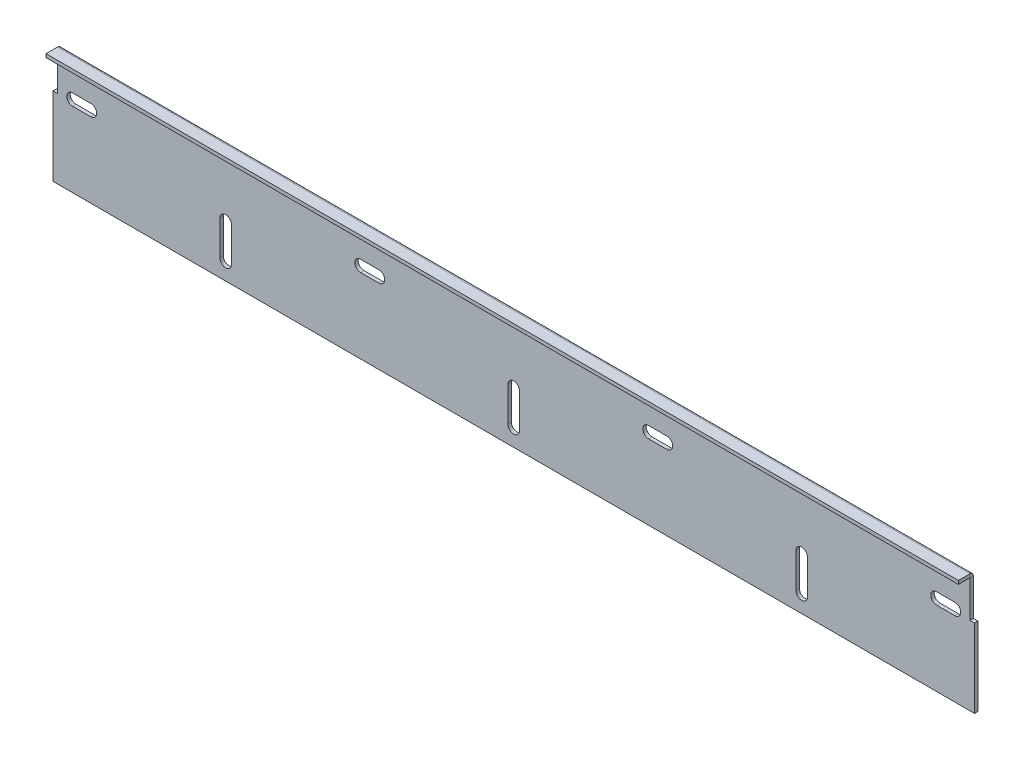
ISO-10303-21;
HEADER;
FILE_DESCRIPTION(('STEP AP214'),'2;1');
FILE_NAME('part.step','',(''),(''),'','','');
FILE_SCHEMA(('AUTOMOTIVE_DESIGN { 1 0 10303 214 1 1 1 1 }'));
ENDSEC;
DATA;
#1=APPLICATION_CONTEXT('core data for automotive mechanical design processes');
#2=APPLICATION_PROTOCOL_DEFINITION('international standard','automotive_design',2000,#1);
#3=PRODUCT_CONTEXT('',#1,'mechanical');
#4=PRODUCT('Part','Part','',(#3));
#5=PRODUCT_RELATED_PRODUCT_CATEGORY('part','',(#4));
#6=PRODUCT_DEFINITION_FORMATION('','',#4);
#7=PRODUCT_DEFINITION_CONTEXT('part definition',#1,'design');
#8=PRODUCT_DEFINITION('design','',#6,#7);
#9=PRODUCT_DEFINITION_SHAPE('','',#8);
#10=(LENGTH_UNIT() NAMED_UNIT(*) SI_UNIT(.MILLI.,.METRE.));
#11=(NAMED_UNIT(*) PLANE_ANGLE_UNIT() SI_UNIT($,.RADIAN.));
#12=(NAMED_UNIT(*) SI_UNIT($,.STERADIAN.) SOLID_ANGLE_UNIT());
#13=UNCERTAINTY_MEASURE_WITH_UNIT(LENGTH_MEASURE(1.E-05),#10,'distance_accuracy_value','');
#14=(GEOMETRIC_REPRESENTATION_CONTEXT(3) GLOBAL_UNCERTAINTY_ASSIGNED_CONTEXT((#13)) GLOBAL_UNIT_ASSIGNED_CONTEXT((#10,
#11,#12)) REPRESENTATION_CONTEXT('',''));
#15=CARTESIAN_POINT('',(0.,0.,0.));
#16=DIRECTION('',(0.,0.,1.));
#17=DIRECTION('',(1.,0.,0.));
#18=AXIS2_PLACEMENT_3D('',#15,#16,#17);
#19=CARTESIAN_POINT('',(-400.,-1551.62497012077,13.));
#20=DIRECTION('',(0.,0.,1.));
#21=DIRECTION('',(0.,-1.,0.));
#22=AXIS2_PLACEMENT_3D('',#19,#20,#21);
#23=PLANE('',#22);
#24=DIRECTION('',(-1.,0.,0.));
#25=VECTOR('',#24,1.);
#26=CARTESIAN_POINT('',(-400.,51.5,13.));
#27=LINE('',#26,#25);
#28=CARTESIAN_POINT('',(396.,51.5,13.));
#29=VERTEX_POINT('',#28);
#30=CARTESIAN_POINT('',(-396.,51.5,13.));
#31=VERTEX_POINT('',#30);
#32=EDGE_CURVE('E502',#29,#31,#27,.T.);
#33=ORIENTED_EDGE('',*,*,#32,.T.);
#34=DIRECTION('',(0.,1.,0.));
#35=VECTOR('',#34,1.);
#36=CARTESIAN_POINT('',(-396.,51.5,13.));
#37=LINE('',#36,#35);
#38=CARTESIAN_POINT('',(-396.,48.5,13.));
#39=VERTEX_POINT('',#38);
#40=EDGE_CURVE('E515',#31,#39,#37,.F.);
#41=ORIENTED_EDGE('',*,*,#40,.T.);
#42=DIRECTION('',(1.,0.,0.));
#43=VECTOR('',#42,1.);
#44=CARTESIAN_POINT('',(-400.,48.5,13.));
#45=LINE('',#44,#43);
#46=CARTESIAN_POINT('',(396.,48.5,13.));
#47=VERTEX_POINT('',#46);
#48=EDGE_CURVE('E41',#39,#47,#45,.T.);
#49=ORIENTED_EDGE('',*,*,#48,.T.);
#50=DIRECTION('',(0.,1.,0.));
#51=VECTOR('',#50,1.);
#52=CARTESIAN_POINT('',(396.,51.5,13.));
#53=LINE('',#52,#51);
#54=EDGE_CURVE('E513',#29,#47,#53,.F.);
#55=ORIENTED_EDGE('',*,*,#54,.F.);
#56=EDGE_LOOP('',(#33,#41,#49,#55));
#57=FACE_BOUND('',#56,.T.);
#58=ADVANCED_FACE('F34',(#57),#23,.T.);
#59=CARTESIAN_POINT('',(-400.,48.5,13.));
#60=DIRECTION('',(0.,1.,0.));
#61=DIRECTION('',(-1.,0.,0.));
#62=AXIS2_PLACEMENT_3D('',#59,#60,#61);
#63=PLANE('',#62);
#64=DIRECTION('',(0.,0.,-1.));
#65=VECTOR('',#64,1.);
#66=CARTESIAN_POINT('',(-396.,48.5,3.));
#67=LINE('',#66,#65);
#68=CARTESIAN_POINT('',(-396.,48.5,3.001));
#69=VERTEX_POINT('',#68);
#70=EDGE_CURVE('E643',#39,#69,#67,.T.);
#71=ORIENTED_EDGE('',*,*,#70,.T.);
#72=DIRECTION('',(1.,0.,0.));
#73=VECTOR('',#72,1.);
#74=CARTESIAN_POINT('',(400.,48.4999999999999,3.001));
#75=LINE('',#74,#73);
#76=CARTESIAN_POINT('',(396.,48.4999999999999,3.001));
#77=VERTEX_POINT('',#76);
#78=EDGE_CURVE('E11',#69,#77,#75,.T.);
#79=ORIENTED_EDGE('',*,*,#78,.T.);
#80=DIRECTION('',(0.,0.,-1.));
#81=VECTOR('',#80,1.);
#82=CARTESIAN_POINT('',(396.,48.5,3.));
#83=LINE('',#82,#81);
#84=EDGE_CURVE('E519',#47,#77,#83,.T.);
#85=ORIENTED_EDGE('',*,*,#84,.F.);
#86=ORIENTED_EDGE('',*,*,#48,.F.);
#87=EDGE_LOOP('',(#71,#79,#85,#86));
#88=FACE_BOUND('',#87,.T.);
#89=ADVANCED_FACE('F523',(#88),#63,.F.);
#90=CARTESIAN_POINT('',(-400.,51.5,3.));
#91=DIRECTION('',(0.,-1.,0.));
#92=DIRECTION('',(0.,0.,-1.));
#93=AXIS2_PLACEMENT_3D('',#90,#91,#92);
#94=PLANE('',#93);
#95=DIRECTION('',(0.,0.,-1.));
#96=VECTOR('',#95,1.);
#97=CARTESIAN_POINT('',(-396.,51.5,3.));
#98=LINE('',#97,#96);
#99=CARTESIAN_POINT('',(-396.,51.5,3.00100000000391));
#100=VERTEX_POINT('',#99);
#101=EDGE_CURVE('E646',#31,#100,#98,.T.);
#102=ORIENTED_EDGE('',*,*,#101,.F.);
#103=ORIENTED_EDGE('',*,*,#32,.F.);
#104=DIRECTION('',(0.,0.,-1.));
#105=VECTOR('',#104,1.);
#106=CARTESIAN_POINT('',(396.,51.5,3.));
#107=LINE('',#106,#105);
#108=CARTESIAN_POINT('',(396.,51.5,3.001));
#109=VERTEX_POINT('',#108);
#110=EDGE_CURVE('E521',#29,#109,#107,.T.);
#111=ORIENTED_EDGE('',*,*,#110,.T.);
#112=DIRECTION('',(-1.,0.,0.));
#113=VECTOR('',#112,1.);
#114=CARTESIAN_POINT('',(400.,51.5,3.001));
#115=LINE('',#114,#113);
#116=EDGE_CURVE('E505',#109,#100,#115,.T.);
#117=ORIENTED_EDGE('',*,*,#116,.T.);
#118=EDGE_LOOP('',(#102,#103,#111,#117));
#119=FACE_BOUND('',#118,.T.);
#120=ADVANCED_FACE('F661',(#119),#94,.F.);
#121=CARTESIAN_POINT('',(-400.,-51.5,3.));
#122=DIRECTION('',(0.,0.,1.));
#123=DIRECTION('',(1.,0.,0.));
#124=AXIS2_PLACEMENT_3D('',#121,#122,#123);
#125=PLANE('',#124);
#126=DIRECTION('',(0.,-1.,0.));
#127=VECTOR('',#126,1.);
#128=CARTESIAN_POINT('',(245.,-6.5,3.));
#129=LINE('',#128,#127);
#130=CARTESIAN_POINT('',(245.,-6.5,3.));
#131=VERTEX_POINT('',#130);
#132=CARTESIAN_POINT('',(245.,-36.5,3.));
#133=VERTEX_POINT('',#132);
#134=EDGE_CURVE('E334',#131,#133,#129,.T.);
#135=ORIENTED_EDGE('',*,*,#134,.F.);
#136=CARTESIAN_POINT('',(250.,-6.5,3.));
#137=DIRECTION('',(0.,0.,1.));
#138=DIRECTION('',(1.,0.,0.));
#139=AXIS2_PLACEMENT_3D('',#136,#137,#138);
#140=CIRCLE('',#139,5.);
#141=CARTESIAN_POINT('',(255.,-6.5,3.));
#142=VERTEX_POINT('',#141);
#143=EDGE_CURVE('E339',#142,#131,#140,.T.);
#144=ORIENTED_EDGE('',*,*,#143,.F.);
#145=DIRECTION('',(0.,1.,0.));
#146=VECTOR('',#145,1.);
#147=CARTESIAN_POINT('',(255.,-6.5,3.));
#148=LINE('',#147,#146);
#149=CARTESIAN_POINT('',(255.,-36.5,3.));
#150=VERTEX_POINT('',#149);
#151=EDGE_CURVE('E345',#150,#142,#148,.T.);
#152=ORIENTED_EDGE('',*,*,#151,.F.);
#153=CARTESIAN_POINT('',(250.,-36.5,3.));
#154=DIRECTION('',(0.,0.,1.));
#155=DIRECTION('',(1.,0.,0.));
#156=AXIS2_PLACEMENT_3D('',#153,#154,#155);
#157=CIRCLE('',#156,5.);
#158=EDGE_CURVE('E351',#133,#150,#157,.T.);
#159=ORIENTED_EDGE('',*,*,#158,.F.);
#160=EDGE_LOOP('',(#135,#144,#152,#159));
#161=FACE_BOUND('',#160,.T.);
#162=DIRECTION('',(1.,0.,0.));
#163=VECTOR('',#162,1.);
#164=CARTESIAN_POINT('',(133.,13.5,3.));
#165=LINE('',#164,#163);
#166=CARTESIAN_POINT('',(117.,13.5,3.));
#167=VERTEX_POINT('',#166);
#168=CARTESIAN_POINT('',(133.,13.5,3.));
#169=VERTEX_POINT('',#168);
#170=EDGE_CURVE('E357',#167,#169,#165,.T.);
#171=ORIENTED_EDGE('',*,*,#170,.F.);
#172=CARTESIAN_POINT('',(117.,18.5,3.));
#173=DIRECTION('',(0.,0.,1.));
#174=DIRECTION('',(1.,0.,0.));
#175=AXIS2_PLACEMENT_3D('',#172,#173,#174);
#176=CIRCLE('',#175,5.);
#177=CARTESIAN_POINT('',(117.,23.5,3.));
#178=VERTEX_POINT('',#177);
#179=EDGE_CURVE('E362',#178,#167,#176,.T.);
#180=ORIENTED_EDGE('',*,*,#179,.F.);
#181=DIRECTION('',(-1.,0.,0.));
#182=VECTOR('',#181,1.);
#183=CARTESIAN_POINT('',(117.,23.5,3.));
#184=LINE('',#183,#182);
#185=CARTESIAN_POINT('',(133.,23.5,3.));
#186=VERTEX_POINT('',#185);
#187=EDGE_CURVE('E368',#186,#178,#184,.T.);
#188=ORIENTED_EDGE('',*,*,#187,.F.);
#189=CARTESIAN_POINT('',(133.,18.5,3.));
#190=DIRECTION('',(0.,0.,1.));
#191=DIRECTION('',(1.,0.,0.));
#192=AXIS2_PLACEMENT_3D('',#189,#190,#191);
#193=CIRCLE('',#192,5.);
#194=EDGE_CURVE('E374',#169,#186,#193,.T.);
#195=ORIENTED_EDGE('',*,*,#194,.F.);
#196=EDGE_LOOP('',(#171,#180,#188,#195));
#197=FACE_BOUND('',#196,.T.);
#198=DIRECTION('',(1.,0.,0.));
#199=VECTOR('',#198,1.);
#200=CARTESIAN_POINT('',(-117.,13.5,3.));
#201=LINE('',#200,#199);
#202=CARTESIAN_POINT('',(-133.,13.5,3.));
#203=VERTEX_POINT('',#202);
#204=CARTESIAN_POINT('',(-117.,13.5,3.));
#205=VERTEX_POINT('',#204);
#206=EDGE_CURVE('E380',#203,#205,#201,.T.);
#207=ORIENTED_EDGE('',*,*,#206,.F.);
#208=CARTESIAN_POINT('',(-133.,18.5,3.));
#209=DIRECTION('',(0.,0.,1.));
#210=DIRECTION('',(1.,0.,0.));
#211=AXIS2_PLACEMENT_3D('',#208,#209,#210);
#212=CIRCLE('',#211,5.);
#213=CARTESIAN_POINT('',(-133.,23.5,3.));
#214=VERTEX_POINT('',#213);
#215=EDGE_CURVE('E385',#214,#203,#212,.T.);
#216=ORIENTED_EDGE('',*,*,#215,.F.);
#217=DIRECTION('',(-1.,0.,0.));
#218=VECTOR('',#217,1.);
#219=CARTESIAN_POINT('',(-133.,23.5,3.));
#220=LINE('',#219,#218);
#221=CARTESIAN_POINT('',(-117.,23.5,3.));
#222=VERTEX_POINT('',#221);
#223=EDGE_CURVE('E391',#222,#214,#220,.T.);
#224=ORIENTED_EDGE('',*,*,#223,.F.);
#225=CARTESIAN_POINT('',(-117.,18.5,3.));
#226=DIRECTION('',(0.,0.,1.));
#227=DIRECTION('',(1.,0.,0.));
#228=AXIS2_PLACEMENT_3D('',#225,#226,#227);
#229=CIRCLE('',#228,5.);
#230=EDGE_CURVE('E397',#205,#222,#229,.T.);
#231=ORIENTED_EDGE('',*,*,#230,.F.);
#232=EDGE_LOOP('',(#207,#216,#224,#231));
#233=FACE_BOUND('',#232,.T.);
#234=DIRECTION('',(1.,0.,0.));
#235=VECTOR('',#234,1.);
#236=CARTESIAN_POINT('',(-383.,13.5,3.));
#237=LINE('',#236,#235);
#238=CARTESIAN_POINT('',(-383.,13.5,3.));
#239=VERTEX_POINT('',#238);
#240=CARTESIAN_POINT('',(-367.,13.5,3.));
#241=VERTEX_POINT('',#240);
#242=EDGE_CURVE('E403',#239,#241,#237,.T.);
#243=ORIENTED_EDGE('',*,*,#242,.F.);
#244=CARTESIAN_POINT('',(-383.,18.5,3.));
#245=DIRECTION('',(0.,0.,1.));
#246=DIRECTION('',(1.,0.,0.));
#247=AXIS2_PLACEMENT_3D('',#244,#245,#246);
#248=CIRCLE('',#247,5.);
#249=CARTESIAN_POINT('',(-383.,23.5,3.));
#250=VERTEX_POINT('',#249);
#251=EDGE_CURVE('E408',#250,#239,#248,.T.);
#252=ORIENTED_EDGE('',*,*,#251,.F.);
#253=DIRECTION('',(-1.,0.,0.));
#254=VECTOR('',#253,1.);
#255=CARTESIAN_POINT('',(-383.,23.5,3.));
#256=LINE('',#255,#254);
#257=CARTESIAN_POINT('',(-367.,23.5,3.));
#258=VERTEX_POINT('',#257);
#259=EDGE_CURVE('E414',#258,#250,#256,.T.);
#260=ORIENTED_EDGE('',*,*,#259,.F.);
#261=CARTESIAN_POINT('',(-367.,18.5,3.));
#262=DIRECTION('',(0.,0.,1.));
#263=DIRECTION('',(1.,0.,0.));
#264=AXIS2_PLACEMENT_3D('',#261,#262,#263);
#265=CIRCLE('',#264,5.);
#266=EDGE_CURVE('E420',#241,#258,#265,.T.);
#267=ORIENTED_EDGE('',*,*,#266,.F.);
#268=EDGE_LOOP('',(#243,#252,#260,#267));
#269=FACE_BOUND('',#268,.T.);
#270=DIRECTION('',(0.,-1.,0.));
#271=VECTOR('',#270,1.);
#272=CARTESIAN_POINT('',(-255.,-6.5,3.));
#273=LINE('',#272,#271);
#274=CARTESIAN_POINT('',(-255.,-6.5,3.));
#275=VERTEX_POINT('',#274);
#276=CARTESIAN_POINT('',(-255.,-36.5,3.));
#277=VERTEX_POINT('',#276);
#278=EDGE_CURVE('E426',#275,#277,#273,.T.);
#279=ORIENTED_EDGE('',*,*,#278,.F.);
#280=CARTESIAN_POINT('',(-250.,-6.5,3.));
#281=DIRECTION('',(0.,0.,1.));
#282=DIRECTION('',(1.,0.,0.));
#283=AXIS2_PLACEMENT_3D('',#280,#281,#282);
#284=CIRCLE('',#283,5.);
#285=CARTESIAN_POINT('',(-245.,-6.5,3.));
#286=VERTEX_POINT('',#285);
#287=EDGE_CURVE('E431',#286,#275,#284,.T.);
#288=ORIENTED_EDGE('',*,*,#287,.F.);
#289=DIRECTION('',(0.,1.,0.));
#290=VECTOR('',#289,1.);
#291=CARTESIAN_POINT('',(-245.,-6.5,3.));
#292=LINE('',#291,#290);
#293=CARTESIAN_POINT('',(-245.,-36.5,3.));
#294=VERTEX_POINT('',#293);
#295=EDGE_CURVE('E437',#294,#286,#292,.T.);
#296=ORIENTED_EDGE('',*,*,#295,.F.);
#297=CARTESIAN_POINT('',(-250.,-36.5,3.));
#298=DIRECTION('',(0.,0.,1.));
#299=DIRECTION('',(1.,0.,0.));
#300=AXIS2_PLACEMENT_3D('',#297,#298,#299);
#301=CIRCLE('',#300,5.);
#302=EDGE_CURVE('E443',#277,#294,#301,.T.);
#303=ORIENTED_EDGE('',*,*,#302,.F.);
#304=EDGE_LOOP('',(#279,#288,#296,#303));
#305=FACE_BOUND('',#304,.T.);
#306=DIRECTION('',(0.,-1.,0.));
#307=VECTOR('',#306,1.);
#308=CARTESIAN_POINT('',(-5.,-6.5,3.));
#309=LINE('',#308,#307);
#310=CARTESIAN_POINT('',(-5.,-6.5,3.));
#311=VERTEX_POINT('',#310);
#312=CARTESIAN_POINT('',(-5.,-36.5,3.));
#313=VERTEX_POINT('',#312);
#314=EDGE_CURVE('E449',#311,#313,#309,.T.);
#315=ORIENTED_EDGE('',*,*,#314,.F.);
#316=CARTESIAN_POINT('',(0.,-6.5,3.));
#317=DIRECTION('',(0.,0.,1.));
#318=DIRECTION('',(1.,0.,0.));
#319=AXIS2_PLACEMENT_3D('',#316,#317,#318);
#320=CIRCLE('',#319,5.);
#321=CARTESIAN_POINT('',(4.99999999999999,-6.5,3.));
#322=VERTEX_POINT('',#321);
#323=EDGE_CURVE('E454',#322,#311,#320,.T.);
#324=ORIENTED_EDGE('',*,*,#323,.F.);
#325=DIRECTION('',(0.,1.,0.));
#326=VECTOR('',#325,1.);
#327=CARTESIAN_POINT('',(4.99999999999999,-6.5,3.));
#328=LINE('',#327,#326);
#329=CARTESIAN_POINT('',(5.,-36.5,3.));
#330=VERTEX_POINT('',#329);
#331=EDGE_CURVE('E460',#330,#322,#328,.T.);
#332=ORIENTED_EDGE('',*,*,#331,.F.);
#333=CARTESIAN_POINT('',(0.,-36.5,3.));
#334=DIRECTION('',(0.,0.,1.));
#335=DIRECTION('',(1.,0.,0.));
#336=AXIS2_PLACEMENT_3D('',#333,#334,#335);
#337=CIRCLE('',#336,5.);
#338=EDGE_CURVE('E466',#313,#330,#337,.T.);
#339=ORIENTED_EDGE('',*,*,#338,.F.);
#340=EDGE_LOOP('',(#315,#324,#332,#339));
#341=FACE_BOUND('',#340,.T.);
#342=DIRECTION('',(1.,0.,0.));
#343=VECTOR('',#342,1.);
#344=CARTESIAN_POINT('',(383.,13.5,3.));
#345=LINE('',#344,#343);
#346=CARTESIAN_POINT('',(367.,13.5,3.));
#347=VERTEX_POINT('',#346);
#348=CARTESIAN_POINT('',(383.,13.5,3.));
#349=VERTEX_POINT('',#348);
#350=EDGE_CURVE('E472',#347,#349,#345,.T.);
#351=ORIENTED_EDGE('',*,*,#350,.F.);
#352=CARTESIAN_POINT('',(367.,18.5,3.));
#353=DIRECTION('',(0.,0.,1.));
#354=DIRECTION('',(1.,0.,0.));
#355=AXIS2_PLACEMENT_3D('',#352,#353,#354);
#356=CIRCLE('',#355,5.);
#357=CARTESIAN_POINT('',(367.,23.5,3.));
#358=VERTEX_POINT('',#357);
#359=EDGE_CURVE('E477',#358,#347,#356,.T.);
#360=ORIENTED_EDGE('',*,*,#359,.F.);
#361=DIRECTION('',(-1.,0.,0.));
#362=VECTOR('',#361,1.);
#363=CARTESIAN_POINT('',(367.,23.5,3.));
#364=LINE('',#363,#362);
#365=CARTESIAN_POINT('',(383.,23.5,3.));
#366=VERTEX_POINT('',#365);
#367=EDGE_CURVE('E483',#366,#358,#364,.T.);
#368=ORIENTED_EDGE('',*,*,#367,.F.);
#369=CARTESIAN_POINT('',(383.,18.5,3.));
#370=DIRECTION('',(0.,0.,1.));
#371=DIRECTION('',(1.,0.,0.));
#372=AXIS2_PLACEMENT_3D('',#369,#370,#371);
#373=CIRCLE('',#372,5.);
#374=EDGE_CURVE('E489',#349,#366,#373,.T.);
#375=ORIENTED_EDGE('',*,*,#374,.F.);
#376=EDGE_LOOP('',(#351,#360,#368,#375));
#377=FACE_BOUND('',#376,.T.);
#378=DIRECTION('',(0.,-1.,0.));
#379=VECTOR('',#378,1.);
#380=CARTESIAN_POINT('',(-396.,-51.5,3.));
#381=LINE('',#380,#379);
#382=CARTESIAN_POINT('',(-396.,48.499,3.00000000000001));
#383=VERTEX_POINT('',#382);
#384=CARTESIAN_POINT('',(-396.,16.5,3.));
#385=VERTEX_POINT('',#384);
#386=EDGE_CURVE('E292',#383,#385,#381,.T.);
#387=ORIENTED_EDGE('',*,*,#386,.T.);
#388=DIRECTION('',(-1.,0.,0.));
#389=VECTOR('',#388,1.);
#390=CARTESIAN_POINT('',(-400.,16.5,3.));
#391=LINE('',#390,#389);
#392=CARTESIAN_POINT('',(-400.,16.5,3.));
#393=VERTEX_POINT('',#392);
#394=EDGE_CURVE('E301',#385,#393,#391,.T.);
#395=ORIENTED_EDGE('',*,*,#394,.T.);
#396=DIRECTION('',(0.,-1.,0.));
#397=VECTOR('',#396,1.);
#398=CARTESIAN_POINT('',(-400.,51.5,3.));
#399=LINE('',#398,#397);
#400=CARTESIAN_POINT('',(-400.,-51.5,2.99999999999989));
#401=VERTEX_POINT('',#400);
#402=EDGE_CURVE('E322',#393,#401,#399,.T.);
#403=ORIENTED_EDGE('',*,*,#402,.T.);
#404=DIRECTION('',(1.,0.,0.));
#405=VECTOR('',#404,1.);
#406=CARTESIAN_POINT('',(-400.,-51.5,3.));
#407=LINE('',#406,#405);
#408=CARTESIAN_POINT('',(400.,-51.5,3.));
#409=VERTEX_POINT('',#408);
#410=EDGE_CURVE('E325',#401,#409,#407,.T.);
#411=ORIENTED_EDGE('',*,*,#410,.T.);
#412=DIRECTION('',(0.,1.,0.));
#413=VECTOR('',#412,1.);
#414=CARTESIAN_POINT('',(400.,51.5,3.));
#415=LINE('',#414,#413);
#416=CARTESIAN_POINT('',(400.,16.5,3.));
#417=VERTEX_POINT('',#416);
#418=EDGE_CURVE('E323',#409,#417,#415,.T.);
#419=ORIENTED_EDGE('',*,*,#418,.T.);
#420=DIRECTION('',(1.,0.,0.));
#421=VECTOR('',#420,1.);
#422=CARTESIAN_POINT('',(-400.,16.5,3.));
#423=LINE('',#422,#421);
#424=CARTESIAN_POINT('',(396.,16.5,3.));
#425=VERTEX_POINT('',#424);
#426=EDGE_CURVE('E626',#425,#417,#423,.T.);
#427=ORIENTED_EDGE('',*,*,#426,.F.);
#428=DIRECTION('',(0.,1.,0.));
#429=VECTOR('',#428,1.);
#430=CARTESIAN_POINT('',(396.,-51.5,3.));
#431=LINE('',#430,#429);
#432=CARTESIAN_POINT('',(396.,48.499,3.00000000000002));
#433=VERTEX_POINT('',#432);
#434=EDGE_CURVE('E321',#433,#425,#431,.F.);
#435=ORIENTED_EDGE('',*,*,#434,.F.);
#436=DIRECTION('',(-1.,0.,0.));
#437=VECTOR('',#436,1.);
#438=CARTESIAN_POINT('',(400.,48.499,2.99999999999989));
#439=LINE('',#438,#437);
#440=EDGE_CURVE('E316',#433,#383,#439,.T.);
#441=ORIENTED_EDGE('',*,*,#440,.T.);
#442=EDGE_LOOP('',(#387,#395,#403,#411,#419,#427,#435,#441));
#443=FACE_BOUND('',#442,.T.);
#444=ADVANCED_FACE('F319',(#161,#197,#233,#269,#305,#341,#377,#443),#125,.T.);
#445=CARTESIAN_POINT('',(-400.,-51.5,0.));
#446=DIRECTION('',(0.,0.,1.));
#447=DIRECTION('',(1.,0.,0.));
#448=AXIS2_PLACEMENT_3D('',#445,#446,#447);
#449=PLANE('',#448);
#450=CARTESIAN_POINT('',(367.,18.5,0.));
#451=DIRECTION('',(0.,0.,1.));
#452=DIRECTION('',(1.,0.,0.));
#453=AXIS2_PLACEMENT_3D('',#450,#451,#452);
#454=CIRCLE('',#453,5.);
#455=CARTESIAN_POINT('',(367.,23.5,0.));
#456=VERTEX_POINT('',#455);
#457=CARTESIAN_POINT('',(367.,13.5,0.));
#458=VERTEX_POINT('',#457);
#459=EDGE_CURVE('E596',#456,#458,#454,.T.);
#460=ORIENTED_EDGE('',*,*,#459,.T.);
#461=DIRECTION('',(1.,0.,0.));
#462=VECTOR('',#461,1.);
#463=CARTESIAN_POINT('',(383.,13.5,0.));
#464=LINE('',#463,#462);
#465=CARTESIAN_POINT('',(383.,13.5,0.));
#466=VERTEX_POINT('',#465);
#467=EDGE_CURVE('E594',#458,#466,#464,.T.);
#468=ORIENTED_EDGE('',*,*,#467,.T.);
#469=CARTESIAN_POINT('',(383.,18.5,0.));
#470=DIRECTION('',(0.,0.,1.));
#471=DIRECTION('',(1.,0.,0.));
#472=AXIS2_PLACEMENT_3D('',#469,#470,#471);
#473=CIRCLE('',#472,5.);
#474=CARTESIAN_POINT('',(383.,23.5,0.));
#475=VERTEX_POINT('',#474);
#476=EDGE_CURVE('E592',#466,#475,#473,.T.);
#477=ORIENTED_EDGE('',*,*,#476,.T.);
#478=DIRECTION('',(-1.,0.,0.));
#479=VECTOR('',#478,1.);
#480=CARTESIAN_POINT('',(367.,23.5,0.));
#481=LINE('',#480,#479);
#482=EDGE_CURVE('E589',#475,#456,#481,.T.);
#483=ORIENTED_EDGE('',*,*,#482,.T.);
#484=EDGE_LOOP('',(#460,#468,#477,#483));
#485=FACE_BOUND('',#484,.T.);
#486=CARTESIAN_POINT('',(0.,-6.5,0.));
#487=DIRECTION('',(0.,0.,1.));
#488=DIRECTION('',(1.,0.,0.));
#489=AXIS2_PLACEMENT_3D('',#486,#487,#488);
#490=CIRCLE('',#489,5.);
#491=CARTESIAN_POINT('',(4.99999999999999,-6.5,0.));
#492=VERTEX_POINT('',#491);
#493=CARTESIAN_POINT('',(-5.,-6.5,0.));
#494=VERTEX_POINT('',#493);
#495=EDGE_CURVE('E587',#492,#494,#490,.T.);
#496=ORIENTED_EDGE('',*,*,#495,.T.);
#497=DIRECTION('',(0.,-1.,0.));
#498=VECTOR('',#497,1.);
#499=CARTESIAN_POINT('',(-5.,-6.5,0.));
#500=LINE('',#499,#498);
#501=CARTESIAN_POINT('',(-5.,-36.5,0.));
#502=VERTEX_POINT('',#501);
#503=EDGE_CURVE('E585',#494,#502,#500,.T.);
#504=ORIENTED_EDGE('',*,*,#503,.T.);
#505=CARTESIAN_POINT('',(0.,-36.5,0.));
#506=DIRECTION('',(0.,0.,1.));
#507=DIRECTION('',(1.,0.,0.));
#508=AXIS2_PLACEMENT_3D('',#505,#506,#507);
#509=CIRCLE('',#508,5.);
#510=CARTESIAN_POINT('',(5.,-36.5,0.));
#511=VERTEX_POINT('',#510);
#512=EDGE_CURVE('E583',#502,#511,#509,.T.);
#513=ORIENTED_EDGE('',*,*,#512,.T.);
#514=DIRECTION('',(0.,1.,0.));
#515=VECTOR('',#514,1.);
#516=CARTESIAN_POINT('',(4.99999999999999,-6.5,0.));
#517=LINE('',#516,#515);
#518=EDGE_CURVE('E580',#511,#492,#517,.T.);
#519=ORIENTED_EDGE('',*,*,#518,.T.);
#520=EDGE_LOOP('',(#496,#504,#513,#519));
#521=FACE_BOUND('',#520,.T.);
#522=CARTESIAN_POINT('',(-250.,-6.5,0.));
#523=DIRECTION('',(0.,0.,1.));
#524=DIRECTION('',(1.,0.,0.));
#525=AXIS2_PLACEMENT_3D('',#522,#523,#524);
#526=CIRCLE('',#525,5.);
#527=CARTESIAN_POINT('',(-245.,-6.5,0.));
#528=VERTEX_POINT('',#527);
#529=CARTESIAN_POINT('',(-255.,-6.5,0.));
#530=VERTEX_POINT('',#529);
#531=EDGE_CURVE('E578',#528,#530,#526,.T.);
#532=ORIENTED_EDGE('',*,*,#531,.T.);
#533=DIRECTION('',(0.,-1.,0.));
#534=VECTOR('',#533,1.);
#535=CARTESIAN_POINT('',(-255.,-6.5,0.));
#536=LINE('',#535,#534);
#537=CARTESIAN_POINT('',(-255.,-36.5,0.));
#538=VERTEX_POINT('',#537);
#539=EDGE_CURVE('E576',#530,#538,#536,.T.);
#540=ORIENTED_EDGE('',*,*,#539,.T.);
#541=CARTESIAN_POINT('',(-250.,-36.5,0.));
#542=DIRECTION('',(0.,0.,1.));
#543=DIRECTION('',(1.,0.,0.));
#544=AXIS2_PLACEMENT_3D('',#541,#542,#543);
#545=CIRCLE('',#544,5.);
#546=CARTESIAN_POINT('',(-245.,-36.5,0.));
#547=VERTEX_POINT('',#546);
#548=EDGE_CURVE('E574',#538,#547,#545,.T.);
#549=ORIENTED_EDGE('',*,*,#548,.T.);
#550=DIRECTION('',(0.,1.,0.));
#551=VECTOR('',#550,1.);
#552=CARTESIAN_POINT('',(-245.,-6.5,0.));
#553=LINE('',#552,#551);
#554=EDGE_CURVE('E571',#547,#528,#553,.T.);
#555=ORIENTED_EDGE('',*,*,#554,.T.);
#556=EDGE_LOOP('',(#532,#540,#549,#555));
#557=FACE_BOUND('',#556,.T.);
#558=CARTESIAN_POINT('',(-383.,18.5,0.));
#559=DIRECTION('',(0.,0.,1.));
#560=DIRECTION('',(1.,0.,0.));
#561=AXIS2_PLACEMENT_3D('',#558,#559,#560);
#562=CIRCLE('',#561,5.);
#563=CARTESIAN_POINT('',(-383.,23.5,0.));
#564=VERTEX_POINT('',#563);
#565=CARTESIAN_POINT('',(-383.,13.5,0.));
#566=VERTEX_POINT('',#565);
#567=EDGE_CURVE('E569',#564,#566,#562,.T.);
#568=ORIENTED_EDGE('',*,*,#567,.T.);
#569=DIRECTION('',(1.,0.,0.));
#570=VECTOR('',#569,1.);
#571=CARTESIAN_POINT('',(-383.,13.5,0.));
#572=LINE('',#571,#570);
#573=CARTESIAN_POINT('',(-367.,13.5,0.));
#574=VERTEX_POINT('',#573);
#575=EDGE_CURVE('E567',#566,#574,#572,.T.);
#576=ORIENTED_EDGE('',*,*,#575,.T.);
#577=CARTESIAN_POINT('',(-367.,18.5,0.));
#578=DIRECTION('',(0.,0.,1.));
#579=DIRECTION('',(1.,0.,0.));
#580=AXIS2_PLACEMENT_3D('',#577,#578,#579);
#581=CIRCLE('',#580,5.);
#582=CARTESIAN_POINT('',(-367.,23.5,0.));
#583=VERTEX_POINT('',#582);
#584=EDGE_CURVE('E565',#574,#583,#581,.T.);
#585=ORIENTED_EDGE('',*,*,#584,.T.);
#586=DIRECTION('',(-1.,0.,0.));
#587=VECTOR('',#586,1.);
#588=CARTESIAN_POINT('',(-383.,23.5,0.));
#589=LINE('',#588,#587);
#590=EDGE_CURVE('E562',#583,#564,#589,.T.);
#591=ORIENTED_EDGE('',*,*,#590,.T.);
#592=EDGE_LOOP('',(#568,#576,#585,#591));
#593=FACE_BOUND('',#592,.T.);
#594=CARTESIAN_POINT('',(-133.,18.5,0.));
#595=DIRECTION('',(0.,0.,1.));
#596=DIRECTION('',(1.,0.,0.));
#597=AXIS2_PLACEMENT_3D('',#594,#595,#596);
#598=CIRCLE('',#597,5.);
#599=CARTESIAN_POINT('',(-133.,23.5,0.));
#600=VERTEX_POINT('',#599);
#601=CARTESIAN_POINT('',(-133.,13.5,0.));
#602=VERTEX_POINT('',#601);
#603=EDGE_CURVE('E560',#600,#602,#598,.T.);
#604=ORIENTED_EDGE('',*,*,#603,.T.);
#605=DIRECTION('',(1.,0.,0.));
#606=VECTOR('',#605,1.);
#607=CARTESIAN_POINT('',(-117.,13.5,0.));
#608=LINE('',#607,#606);
#609=CARTESIAN_POINT('',(-117.,13.5,0.));
#610=VERTEX_POINT('',#609);
#611=EDGE_CURVE('E558',#602,#610,#608,.T.);
#612=ORIENTED_EDGE('',*,*,#611,.T.);
#613=CARTESIAN_POINT('',(-117.,18.5,0.));
#614=DIRECTION('',(0.,0.,1.));
#615=DIRECTION('',(1.,0.,0.));
#616=AXIS2_PLACEMENT_3D('',#613,#614,#615);
#617=CIRCLE('',#616,5.);
#618=CARTESIAN_POINT('',(-117.,23.5,0.));
#619=VERTEX_POINT('',#618);
#620=EDGE_CURVE('E556',#610,#619,#617,.T.);
#621=ORIENTED_EDGE('',*,*,#620,.T.);
#622=DIRECTION('',(-1.,0.,0.));
#623=VECTOR('',#622,1.);
#624=CARTESIAN_POINT('',(-133.,23.5,0.));
#625=LINE('',#624,#623);
#626=EDGE_CURVE('E553',#619,#600,#625,.T.);
#627=ORIENTED_EDGE('',*,*,#626,.T.);
#628=EDGE_LOOP('',(#604,#612,#621,#627));
#629=FACE_BOUND('',#628,.T.);
#630=CARTESIAN_POINT('',(117.,18.5,0.));
#631=DIRECTION('',(0.,0.,1.));
#632=DIRECTION('',(1.,0.,0.));
#633=AXIS2_PLACEMENT_3D('',#630,#631,#632);
#634=CIRCLE('',#633,5.);
#635=CARTESIAN_POINT('',(117.,23.5,0.));
#636=VERTEX_POINT('',#635);
#637=CARTESIAN_POINT('',(117.,13.5,0.));
#638=VERTEX_POINT('',#637);
#639=EDGE_CURVE('E551',#636,#638,#634,.T.);
#640=ORIENTED_EDGE('',*,*,#639,.T.);
#641=DIRECTION('',(1.,0.,0.));
#642=VECTOR('',#641,1.);
#643=CARTESIAN_POINT('',(133.,13.5,0.));
#644=LINE('',#643,#642);
#645=CARTESIAN_POINT('',(133.,13.5,0.));
#646=VERTEX_POINT('',#645);
#647=EDGE_CURVE('E549',#638,#646,#644,.T.);
#648=ORIENTED_EDGE('',*,*,#647,.T.);
#649=CARTESIAN_POINT('',(133.,18.5,0.));
#650=DIRECTION('',(0.,0.,1.));
#651=DIRECTION('',(1.,0.,0.));
#652=AXIS2_PLACEMENT_3D('',#649,#650,#651);
#653=CIRCLE('',#652,5.);
#654=CARTESIAN_POINT('',(133.,23.5,0.));
#655=VERTEX_POINT('',#654);
#656=EDGE_CURVE('E547',#646,#655,#653,.T.);
#657=ORIENTED_EDGE('',*,*,#656,.T.);
#658=DIRECTION('',(-1.,0.,0.));
#659=VECTOR('',#658,1.);
#660=CARTESIAN_POINT('',(117.,23.5,0.));
#661=LINE('',#660,#659);
#662=EDGE_CURVE('E544',#655,#636,#661,.T.);
#663=ORIENTED_EDGE('',*,*,#662,.T.);
#664=EDGE_LOOP('',(#640,#648,#657,#663));
#665=FACE_BOUND('',#664,.T.);
#666=CARTESIAN_POINT('',(250.,-6.5,0.));
#667=DIRECTION('',(0.,0.,1.));
#668=DIRECTION('',(1.,0.,0.));
#669=AXIS2_PLACEMENT_3D('',#666,#667,#668);
#670=CIRCLE('',#669,5.);
#671=CARTESIAN_POINT('',(255.,-6.5,0.));
#672=VERTEX_POINT('',#671);
#673=CARTESIAN_POINT('',(245.,-6.5,0.));
#674=VERTEX_POINT('',#673);
#675=EDGE_CURVE('E542',#672,#674,#670,.T.);
#676=ORIENTED_EDGE('',*,*,#675,.T.);
#677=DIRECTION('',(0.,-1.,0.));
#678=VECTOR('',#677,1.);
#679=CARTESIAN_POINT('',(245.,-6.5,0.));
#680=LINE('',#679,#678);
#681=CARTESIAN_POINT('',(245.,-36.5,0.));
#682=VERTEX_POINT('',#681);
#683=EDGE_CURVE('E540',#674,#682,#680,.T.);
#684=ORIENTED_EDGE('',*,*,#683,.T.);
#685=CARTESIAN_POINT('',(250.,-36.5,0.));
#686=DIRECTION('',(0.,0.,1.));
#687=DIRECTION('',(1.,0.,0.));
#688=AXIS2_PLACEMENT_3D('',#685,#686,#687);
#689=CIRCLE('',#688,5.);
#690=CARTESIAN_POINT('',(255.,-36.5,0.));
#691=VERTEX_POINT('',#690);
#692=EDGE_CURVE('E538',#682,#691,#689,.T.);
#693=ORIENTED_EDGE('',*,*,#692,.T.);
#694=DIRECTION('',(0.,1.,0.));
#695=VECTOR('',#694,1.);
#696=CARTESIAN_POINT('',(255.,-6.5,0.));
#697=LINE('',#696,#695);
#698=EDGE_CURVE('E535',#691,#672,#697,.T.);
#699=ORIENTED_EDGE('',*,*,#698,.T.);
#700=EDGE_LOOP('',(#676,#684,#693,#699));
#701=FACE_BOUND('',#700,.T.);
#702=DIRECTION('',(1.,0.,0.));
#703=VECTOR('',#702,1.);
#704=CARTESIAN_POINT('',(-400.,16.5,0.));
#705=LINE('',#704,#703);
#706=CARTESIAN_POINT('',(-396.,16.5,0.));
#707=VERTEX_POINT('',#706);
#708=CARTESIAN_POINT('',(-400.,16.5,0.));
#709=VERTEX_POINT('',#708);
#710=EDGE_CURVE('E48',#707,#709,#705,.F.);
#711=ORIENTED_EDGE('',*,*,#710,.F.);
#712=DIRECTION('',(0.,1.,0.));
#713=VECTOR('',#712,1.);
#714=CARTESIAN_POINT('',(-396.,-51.5,0.));
#715=LINE('',#714,#713);
#716=CARTESIAN_POINT('',(-396.,48.4989999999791,0.));
#717=VERTEX_POINT('',#716);
#718=EDGE_CURVE('E651',#717,#707,#715,.F.);
#719=ORIENTED_EDGE('',*,*,#718,.F.);
#720=DIRECTION('',(-1.,0.,0.));
#721=VECTOR('',#720,1.);
#722=CARTESIAN_POINT('',(400.,48.499,0.));
#723=LINE('',#722,#721);
#724=CARTESIAN_POINT('',(396.,48.499,0.));
#725=VERTEX_POINT('',#724);
#726=EDGE_CURVE('E498',#725,#717,#723,.T.);
#727=ORIENTED_EDGE('',*,*,#726,.F.);
#728=DIRECTION('',(0.,-1.,0.));
#729=VECTOR('',#728,1.);
#730=CARTESIAN_POINT('',(396.,64.2548377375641,0.));
#731=LINE('',#730,#729);
#732=CARTESIAN_POINT('',(396.,16.5,0.));
#733=VERTEX_POINT('',#732);
#734=EDGE_CURVE('E633',#725,#733,#731,.T.);
#735=ORIENTED_EDGE('',*,*,#734,.T.);
#736=DIRECTION('',(1.,0.,0.));
#737=VECTOR('',#736,1.);
#738=CARTESIAN_POINT('',(410.027668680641,16.5,0.));
#739=LINE('',#738,#737);
#740=CARTESIAN_POINT('',(400.,16.5,0.));
#741=VERTEX_POINT('',#740);
#742=EDGE_CURVE('E629',#733,#741,#739,.T.);
#743=ORIENTED_EDGE('',*,*,#742,.T.);
#744=DIRECTION('',(0.,1.,0.));
#745=VECTOR('',#744,1.);
#746=CARTESIAN_POINT('',(400.,51.5,0.));
#747=LINE('',#746,#745);
#748=CARTESIAN_POINT('',(400.,-51.5,0.));
#749=VERTEX_POINT('',#748);
#750=EDGE_CURVE('E506',#749,#741,#747,.T.);
#751=ORIENTED_EDGE('',*,*,#750,.F.);
#752=DIRECTION('',(1.,0.,0.));
#753=VECTOR('',#752,1.);
#754=CARTESIAN_POINT('',(-400.,-51.5,0.));
#755=LINE('',#754,#753);
#756=CARTESIAN_POINT('',(-400.,-51.5,0.));
#757=VERTEX_POINT('',#756);
#758=EDGE_CURVE('E492',#757,#749,#755,.T.);
#759=ORIENTED_EDGE('',*,*,#758,.F.);
#760=DIRECTION('',(0.,-1.,0.));
#761=VECTOR('',#760,1.);
#762=CARTESIAN_POINT('',(-400.,51.5,0.));
#763=LINE('',#762,#761);
#764=EDGE_CURVE('E599',#709,#757,#763,.T.);
#765=ORIENTED_EDGE('',*,*,#764,.F.);
#766=EDGE_LOOP('',(#711,#719,#727,#735,#743,#751,#759,#765));
#767=FACE_BOUND('',#766,.T.);
#768=ADVANCED_FACE('F613',(#485,#521,#557,#593,#629,#665,#701,#767),#449,.F.);
#769=CARTESIAN_POINT('',(1207.53388728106,48.499,3.001));
#770=DIRECTION('',(-1.,0.,0.));
#771=DIRECTION('',(0.,-1.,0.));
#772=AXIS2_PLACEMENT_3D('',#769,#770,#771);
#773=CYLINDRICAL_SURFACE('',#772,3.00099999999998);
#774=ORIENTED_EDGE('',*,*,#726,.T.);
#775=CARTESIAN_POINT('',(-396.,48.499,3.001));
#776=DIRECTION('',(-1.,0.,0.));
#777=DIRECTION('',(0.,-1.,0.));
#778=AXIS2_PLACEMENT_3D('',#775,#776,#777);
#779=CIRCLE('',#778,3.001);
#780=EDGE_CURVE('E302',#717,#100,#779,.F.);
#781=ORIENTED_EDGE('',*,*,#780,.T.);
#782=ORIENTED_EDGE('',*,*,#116,.F.);
#783=CARTESIAN_POINT('',(396.,48.499,3.001));
#784=DIRECTION('',(-1.,0.,0.));
#785=DIRECTION('',(0.,0.,1.));
#786=AXIS2_PLACEMENT_3D('',#783,#784,#785);
#787=CIRCLE('',#786,3.00099999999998);
#788=EDGE_CURVE('E638',#725,#109,#787,.F.);
#789=ORIENTED_EDGE('',*,*,#788,.F.);
#790=EDGE_LOOP('',(#774,#781,#782,#789));
#791=FACE_BOUND('',#790,.T.);
#792=ADVANCED_FACE('F656',(#791),#773,.T.);
#793=CARTESIAN_POINT('',(1207.53388728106,48.499,3.001));
#794=DIRECTION('',(-1.,0.,0.));
#795=DIRECTION('',(0.,-1.,0.));
#796=AXIS2_PLACEMENT_3D('',#793,#794,#795);
#797=CYLINDRICAL_SURFACE('',#796,0.000999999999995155);
#798=CARTESIAN_POINT('',(-396.,48.499,3.001));
#799=DIRECTION('',(-1.,0.,0.));
#800=DIRECTION('',(0.,0.,1.));
#801=AXIS2_PLACEMENT_3D('',#798,#799,#800);
#802=CIRCLE('',#801,0.000999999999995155);
#803=EDGE_CURVE('E308',#383,#69,#802,.F.);
#804=ORIENTED_EDGE('',*,*,#803,.F.);
#805=ORIENTED_EDGE('',*,*,#440,.F.);
#806=CARTESIAN_POINT('',(396.,48.499,3.001));
#807=DIRECTION('',(-1.,0.,0.));
#808=DIRECTION('',(0.,-1.,0.));
#809=AXIS2_PLACEMENT_3D('',#806,#807,#808);
#810=CIRCLE('',#809,0.000999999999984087);
#811=EDGE_CURVE('E636',#433,#77,#810,.F.);
#812=ORIENTED_EDGE('',*,*,#811,.T.);
#813=ORIENTED_EDGE('',*,*,#78,.F.);
#814=EDGE_LOOP('',(#804,#805,#812,#813));
#815=FACE_BOUND('',#814,.T.);
#816=ADVANCED_FACE('F314',(#815),#797,.F.);
#817=CARTESIAN_POINT('',(-400.,51.5,1615.45130159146));
#818=DIRECTION('',(1.,0.,0.));
#819=DIRECTION('',(0.,0.,-1.));
#820=AXIS2_PLACEMENT_3D('',#817,#818,#819);
#821=PLANE('',#820);
#822=DIRECTION('',(0.,0.,1.));
#823=VECTOR('',#822,1.);
#824=CARTESIAN_POINT('',(-400.,16.5,3.));
#825=LINE('',#824,#823);
#826=EDGE_CURVE('E611',#393,#709,#825,.F.);
#827=ORIENTED_EDGE('',*,*,#826,.T.);
#828=ORIENTED_EDGE('',*,*,#764,.T.);
#829=DIRECTION('',(0.,0.,-1.));
#830=VECTOR('',#829,1.);
#831=CARTESIAN_POINT('',(-400.,-51.5,1615.45130159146));
#832=LINE('',#831,#830);
#833=EDGE_CURVE('E495',#401,#757,#832,.T.);
#834=ORIENTED_EDGE('',*,*,#833,.F.);
#835=ORIENTED_EDGE('',*,*,#402,.F.);
#836=EDGE_LOOP('',(#827,#828,#834,#835));
#837=FACE_BOUND('',#836,.T.);
#838=ADVANCED_FACE('F608',(#837),#821,.F.);
#839=CARTESIAN_POINT('',(400.,51.5,1615.45130159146));
#840=DIRECTION('',(-1.,0.,0.));
#841=DIRECTION('',(0.,0.,1.));
#842=AXIS2_PLACEMENT_3D('',#839,#840,#841);
#843=PLANE('',#842);
#844=DIRECTION('',(0.,0.,-1.));
#845=VECTOR('',#844,1.);
#846=CARTESIAN_POINT('',(400.,16.5,0.));
#847=LINE('',#846,#845);
#848=EDGE_CURVE('E525',#741,#417,#847,.F.);
#849=ORIENTED_EDGE('',*,*,#848,.T.);
#850=ORIENTED_EDGE('',*,*,#418,.F.);
#851=DIRECTION('',(0.,0.,-1.));
#852=VECTOR('',#851,1.);
#853=CARTESIAN_POINT('',(400.,-51.5,1615.45130159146));
#854=LINE('',#853,#852);
#855=EDGE_CURVE('E532',#409,#749,#854,.T.);
#856=ORIENTED_EDGE('',*,*,#855,.T.);
#857=ORIENTED_EDGE('',*,*,#750,.T.);
#858=EDGE_LOOP('',(#849,#850,#856,#857));
#859=FACE_BOUND('',#858,.T.);
#860=ADVANCED_FACE('F617',(#859),#843,.F.);
#861=CARTESIAN_POINT('',(-400.,-51.5,1615.45130159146));
#862=DIRECTION('',(0.,1.,0.));
#863=DIRECTION('',(0.,0.,1.));
#864=AXIS2_PLACEMENT_3D('',#861,#862,#863);
#865=PLANE('',#864);
#866=ORIENTED_EDGE('',*,*,#833,.T.);
#867=ORIENTED_EDGE('',*,*,#758,.T.);
#868=ORIENTED_EDGE('',*,*,#855,.F.);
#869=ORIENTED_EDGE('',*,*,#410,.F.);
#870=EDGE_LOOP('',(#866,#867,#868,#869));
#871=FACE_BOUND('',#870,.T.);
#872=ADVANCED_FACE('F606',(#871),#865,.F.);
#873=CARTESIAN_POINT('',(383.,18.5,3.));
#874=DIRECTION('',(0.,0.,-1.));
#875=DIRECTION('',(-1.,0.,0.));
#876=AXIS2_PLACEMENT_3D('',#873,#874,#875);
#877=CYLINDRICAL_SURFACE('',#876,5.);
#878=ORIENTED_EDGE('',*,*,#476,.F.);
#879=DIRECTION('',(0.,0.,-1.));
#880=VECTOR('',#879,1.);
#881=CARTESIAN_POINT('',(383.,13.5,3.));
#882=LINE('',#881,#880);
#883=EDGE_CURVE('E469',#349,#466,#882,.T.);
#884=ORIENTED_EDGE('',*,*,#883,.F.);
#885=ORIENTED_EDGE('',*,*,#374,.T.);
#886=DIRECTION('',(0.,0.,-1.));
#887=VECTOR('',#886,1.);
#888=CARTESIAN_POINT('',(383.,23.5,3.));
#889=LINE('',#888,#887);
#890=EDGE_CURVE('E486',#366,#475,#889,.T.);
#891=ORIENTED_EDGE('',*,*,#890,.T.);
#892=EDGE_LOOP('',(#878,#884,#885,#891));
#893=FACE_BOUND('',#892,.T.);
#894=ADVANCED_FACE('F802',(#893),#877,.F.);
#895=CARTESIAN_POINT('',(367.,23.5,3.));
#896=DIRECTION('',(0.,-1.,0.));
#897=DIRECTION('',(0.,0.,-1.));
#898=AXIS2_PLACEMENT_3D('',#895,#896,#897);
#899=PLANE('',#898);
#900=ORIENTED_EDGE('',*,*,#482,.F.);
#901=ORIENTED_EDGE('',*,*,#890,.F.);
#902=ORIENTED_EDGE('',*,*,#367,.T.);
#903=DIRECTION('',(0.,0.,-1.));
#904=VECTOR('',#903,1.);
#905=CARTESIAN_POINT('',(367.,23.5,3.));
#906=LINE('',#905,#904);
#907=EDGE_CURVE('E480',#358,#456,#906,.T.);
#908=ORIENTED_EDGE('',*,*,#907,.T.);
#909=EDGE_LOOP('',(#900,#901,#902,#908));
#910=FACE_BOUND('',#909,.T.);
#911=ADVANCED_FACE('F798',(#910),#899,.T.);
#912=CARTESIAN_POINT('',(367.,18.5,3.));
#913=DIRECTION('',(0.,0.,-1.));
#914=DIRECTION('',(-1.,0.,0.));
#915=AXIS2_PLACEMENT_3D('',#912,#913,#914);
#916=CYLINDRICAL_SURFACE('',#915,5.);
#917=ORIENTED_EDGE('',*,*,#459,.F.);
#918=ORIENTED_EDGE('',*,*,#907,.F.);
#919=ORIENTED_EDGE('',*,*,#359,.T.);
#920=DIRECTION('',(0.,0.,-1.));
#921=VECTOR('',#920,1.);
#922=CARTESIAN_POINT('',(367.,13.5,3.));
#923=LINE('',#922,#921);
#924=EDGE_CURVE('E474',#347,#458,#923,.T.);
#925=ORIENTED_EDGE('',*,*,#924,.T.);
#926=EDGE_LOOP('',(#917,#918,#919,#925));
#927=FACE_BOUND('',#926,.T.);
#928=ADVANCED_FACE('F794',(#927),#916,.F.);
#929=CARTESIAN_POINT('',(383.,13.5,3.));
#930=DIRECTION('',(0.,1.,0.));
#931=DIRECTION('',(-1.,0.,0.));
#932=AXIS2_PLACEMENT_3D('',#929,#930,#931);
#933=PLANE('',#932);
#934=ORIENTED_EDGE('',*,*,#467,.F.);
#935=ORIENTED_EDGE('',*,*,#924,.F.);
#936=ORIENTED_EDGE('',*,*,#350,.T.);
#937=ORIENTED_EDGE('',*,*,#883,.T.);
#938=EDGE_LOOP('',(#934,#935,#936,#937));
#939=FACE_BOUND('',#938,.T.);
#940=ADVANCED_FACE('F790',(#939),#933,.T.);
#941=CARTESIAN_POINT('',(0.,-36.5,3.));
#942=DIRECTION('',(0.,0.,-1.));
#943=DIRECTION('',(-1.,0.,0.));
#944=AXIS2_PLACEMENT_3D('',#941,#942,#943);
#945=CYLINDRICAL_SURFACE('',#944,5.);
#946=ORIENTED_EDGE('',*,*,#512,.F.);
#947=DIRECTION('',(0.,0.,-1.));
#948=VECTOR('',#947,1.);
#949=CARTESIAN_POINT('',(-5.,-36.5,3.));
#950=LINE('',#949,#948);
#951=EDGE_CURVE('E446',#313,#502,#950,.T.);
#952=ORIENTED_EDGE('',*,*,#951,.F.);
#953=ORIENTED_EDGE('',*,*,#338,.T.);
#954=DIRECTION('',(0.,0.,-1.));
#955=VECTOR('',#954,1.);
#956=CARTESIAN_POINT('',(5.,-36.5,3.));
#957=LINE('',#956,#955);
#958=EDGE_CURVE('E463',#330,#511,#957,.T.);
#959=ORIENTED_EDGE('',*,*,#958,.T.);
#960=EDGE_LOOP('',(#946,#952,#953,#959));
#961=FACE_BOUND('',#960,.T.);
#962=ADVANCED_FACE('F786',(#961),#945,.F.);
#963=CARTESIAN_POINT('',(4.99999999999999,-6.5,3.));
#964=DIRECTION('',(-1.,0.,0.));
#965=DIRECTION('',(0.,-1.,0.));
#966=AXIS2_PLACEMENT_3D('',#963,#964,#965);
#967=PLANE('',#966);
#968=ORIENTED_EDGE('',*,*,#518,.F.);
#969=ORIENTED_EDGE('',*,*,#958,.F.);
#970=ORIENTED_EDGE('',*,*,#331,.T.);
#971=DIRECTION('',(0.,0.,-1.));
#972=VECTOR('',#971,1.);
#973=CARTESIAN_POINT('',(4.99999999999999,-6.5,3.));
#974=LINE('',#973,#972);
#975=EDGE_CURVE('E457',#322,#492,#974,.T.);
#976=ORIENTED_EDGE('',*,*,#975,.T.);
#977=EDGE_LOOP('',(#968,#969,#970,#976));
#978=FACE_BOUND('',#977,.T.);
#979=ADVANCED_FACE('F782',(#978),#967,.T.);
#980=CARTESIAN_POINT('',(0.,-6.5,3.));
#981=DIRECTION('',(0.,0.,-1.));
#982=DIRECTION('',(-1.,0.,0.));
#983=AXIS2_PLACEMENT_3D('',#980,#981,#982);
#984=CYLINDRICAL_SURFACE('',#983,5.);
#985=ORIENTED_EDGE('',*,*,#495,.F.);
#986=ORIENTED_EDGE('',*,*,#975,.F.);
#987=ORIENTED_EDGE('',*,*,#323,.T.);
#988=DIRECTION('',(0.,0.,-1.));
#989=VECTOR('',#988,1.);
#990=CARTESIAN_POINT('',(-5.,-6.5,3.));
#991=LINE('',#990,#989);
#992=EDGE_CURVE('E451',#311,#494,#991,.T.);
#993=ORIENTED_EDGE('',*,*,#992,.T.);
#994=EDGE_LOOP('',(#985,#986,#987,#993));
#995=FACE_BOUND('',#994,.T.);
#996=ADVANCED_FACE('F778',(#995),#984,.F.);
#997=CARTESIAN_POINT('',(-5.,-6.5,3.));
#998=DIRECTION('',(1.,0.,0.));
#999=DIRECTION('',(0.,1.,0.));
#1000=AXIS2_PLACEMENT_3D('',#997,#998,#999);
#1001=PLANE('',#1000);
#1002=ORIENTED_EDGE('',*,*,#503,.F.);
#1003=ORIENTED_EDGE('',*,*,#992,.F.);
#1004=ORIENTED_EDGE('',*,*,#314,.T.);
#1005=ORIENTED_EDGE('',*,*,#951,.T.);
#1006=EDGE_LOOP('',(#1002,#1003,#1004,#1005));
#1007=FACE_BOUND('',#1006,.T.);
#1008=ADVANCED_FACE('F774',(#1007),#1001,.T.);
#1009=CARTESIAN_POINT('',(-250.,-36.5,3.));
#1010=DIRECTION('',(0.,0.,-1.));
#1011=DIRECTION('',(-1.,0.,0.));
#1012=AXIS2_PLACEMENT_3D('',#1009,#1010,#1011);
#1013=CYLINDRICAL_SURFACE('',#1012,5.);
#1014=ORIENTED_EDGE('',*,*,#548,.F.);
#1015=DIRECTION('',(0.,0.,-1.));
#1016=VECTOR('',#1015,1.);
#1017=CARTESIAN_POINT('',(-255.,-36.5,3.));
#1018=LINE('',#1017,#1016);
#1019=EDGE_CURVE('E423',#277,#538,#1018,.T.);
#1020=ORIENTED_EDGE('',*,*,#1019,.F.);
#1021=ORIENTED_EDGE('',*,*,#302,.T.);
#1022=DIRECTION('',(0.,0.,-1.));
#1023=VECTOR('',#1022,1.);
#1024=CARTESIAN_POINT('',(-245.,-36.5,3.));
#1025=LINE('',#1024,#1023);
#1026=EDGE_CURVE('E440',#294,#547,#1025,.T.);
#1027=ORIENTED_EDGE('',*,*,#1026,.T.);
#1028=EDGE_LOOP('',(#1014,#1020,#1021,#1027));
#1029=FACE_BOUND('',#1028,.T.);
#1030=ADVANCED_FACE('F770',(#1029),#1013,.F.);
#1031=CARTESIAN_POINT('',(-245.,-6.5,3.));
#1032=DIRECTION('',(-1.,0.,0.));
#1033=DIRECTION('',(0.,0.,1.));
#1034=AXIS2_PLACEMENT_3D('',#1031,#1032,#1033);
#1035=PLANE('',#1034);
#1036=ORIENTED_EDGE('',*,*,#554,.F.);
#1037=ORIENTED_EDGE('',*,*,#1026,.F.);
#1038=ORIENTED_EDGE('',*,*,#295,.T.);
#1039=DIRECTION('',(0.,0.,-1.));
#1040=VECTOR('',#1039,1.);
#1041=CARTESIAN_POINT('',(-245.,-6.5,3.));
#1042=LINE('',#1041,#1040);
#1043=EDGE_CURVE('E434',#286,#528,#1042,.T.);
#1044=ORIENTED_EDGE('',*,*,#1043,.T.);
#1045=EDGE_LOOP('',(#1036,#1037,#1038,#1044));
#1046=FACE_BOUND('',#1045,.T.);
#1047=ADVANCED_FACE('F766',(#1046),#1035,.T.);
#1048=CARTESIAN_POINT('',(-250.,-6.5,3.));
#1049=DIRECTION('',(0.,0.,-1.));
#1050=DIRECTION('',(-1.,0.,0.));
#1051=AXIS2_PLACEMENT_3D('',#1048,#1049,#1050);
#1052=CYLINDRICAL_SURFACE('',#1051,5.);
#1053=ORIENTED_EDGE('',*,*,#531,.F.);
#1054=ORIENTED_EDGE('',*,*,#1043,.F.);
#1055=ORIENTED_EDGE('',*,*,#287,.T.);
#1056=DIRECTION('',(0.,0.,-1.));
#1057=VECTOR('',#1056,1.);
#1058=CARTESIAN_POINT('',(-255.,-6.5,3.));
#1059=LINE('',#1058,#1057);
#1060=EDGE_CURVE('E428',#275,#530,#1059,.T.);
#1061=ORIENTED_EDGE('',*,*,#1060,.T.);
#1062=EDGE_LOOP('',(#1053,#1054,#1055,#1061));
#1063=FACE_BOUND('',#1062,.T.);
#1064=ADVANCED_FACE('F762',(#1063),#1052,.F.);
#1065=CARTESIAN_POINT('',(-255.,-6.5,3.));
#1066=DIRECTION('',(1.,0.,0.));
#1067=DIRECTION('',(0.,0.,-1.));
#1068=AXIS2_PLACEMENT_3D('',#1065,#1066,#1067);
#1069=PLANE('',#1068);
#1070=ORIENTED_EDGE('',*,*,#539,.F.);
#1071=ORIENTED_EDGE('',*,*,#1060,.F.);
#1072=ORIENTED_EDGE('',*,*,#278,.T.);
#1073=ORIENTED_EDGE('',*,*,#1019,.T.);
#1074=EDGE_LOOP('',(#1070,#1071,#1072,#1073));
#1075=FACE_BOUND('',#1074,.T.);
#1076=ADVANCED_FACE('F758',(#1075),#1069,.T.);
#1077=CARTESIAN_POINT('',(-367.,18.5,3.));
#1078=DIRECTION('',(0.,0.,-1.));
#1079=DIRECTION('',(-1.,0.,0.));
#1080=AXIS2_PLACEMENT_3D('',#1077,#1078,#1079);
#1081=CYLINDRICAL_SURFACE('',#1080,5.);
#1082=ORIENTED_EDGE('',*,*,#584,.F.);
#1083=DIRECTION('',(0.,0.,-1.));
#1084=VECTOR('',#1083,1.);
#1085=CARTESIAN_POINT('',(-367.,13.5,3.));
#1086=LINE('',#1085,#1084);
#1087=EDGE_CURVE('E400',#241,#574,#1086,.T.);
#1088=ORIENTED_EDGE('',*,*,#1087,.F.);
#1089=ORIENTED_EDGE('',*,*,#266,.T.);
#1090=DIRECTION('',(0.,0.,-1.));
#1091=VECTOR('',#1090,1.);
#1092=CARTESIAN_POINT('',(-367.,23.5,3.));
#1093=LINE('',#1092,#1091);
#1094=EDGE_CURVE('E417',#258,#583,#1093,.T.);
#1095=ORIENTED_EDGE('',*,*,#1094,.T.);
#1096=EDGE_LOOP('',(#1082,#1088,#1089,#1095));
#1097=FACE_BOUND('',#1096,.T.);
#1098=ADVANCED_FACE('F754',(#1097),#1081,.F.);
#1099=CARTESIAN_POINT('',(-383.,23.5,3.));
#1100=DIRECTION('',(0.,-1.,0.));
#1101=DIRECTION('',(1.,0.,0.));
#1102=AXIS2_PLACEMENT_3D('',#1099,#1100,#1101);
#1103=PLANE('',#1102);
#1104=ORIENTED_EDGE('',*,*,#590,.F.);
#1105=ORIENTED_EDGE('',*,*,#1094,.F.);
#1106=ORIENTED_EDGE('',*,*,#259,.T.);
#1107=DIRECTION('',(0.,0.,-1.));
#1108=VECTOR('',#1107,1.);
#1109=CARTESIAN_POINT('',(-383.,23.5,3.));
#1110=LINE('',#1109,#1108);
#1111=EDGE_CURVE('E411',#250,#564,#1110,.T.);
#1112=ORIENTED_EDGE('',*,*,#1111,.T.);
#1113=EDGE_LOOP('',(#1104,#1105,#1106,#1112));
#1114=FACE_BOUND('',#1113,.T.);
#1115=ADVANCED_FACE('F750',(#1114),#1103,.T.);
#1116=CARTESIAN_POINT('',(-383.,18.5,3.));
#1117=DIRECTION('',(0.,0.,-1.));
#1118=DIRECTION('',(-1.,0.,0.));
#1119=AXIS2_PLACEMENT_3D('',#1116,#1117,#1118);
#1120=CYLINDRICAL_SURFACE('',#1119,5.);
#1121=ORIENTED_EDGE('',*,*,#567,.F.);
#1122=ORIENTED_EDGE('',*,*,#1111,.F.);
#1123=ORIENTED_EDGE('',*,*,#251,.T.);
#1124=DIRECTION('',(0.,0.,-1.));
#1125=VECTOR('',#1124,1.);
#1126=CARTESIAN_POINT('',(-383.,13.5,3.));
#1127=LINE('',#1126,#1125);
#1128=EDGE_CURVE('E405',#239,#566,#1127,.T.);
#1129=ORIENTED_EDGE('',*,*,#1128,.T.);
#1130=EDGE_LOOP('',(#1121,#1122,#1123,#1129));
#1131=FACE_BOUND('',#1130,.T.);
#1132=ADVANCED_FACE('F746',(#1131),#1120,.F.);
#1133=CARTESIAN_POINT('',(-383.,13.5,3.));
#1134=DIRECTION('',(0.,1.,0.));
#1135=DIRECTION('',(0.,0.,1.));
#1136=AXIS2_PLACEMENT_3D('',#1133,#1134,#1135);
#1137=PLANE('',#1136);
#1138=ORIENTED_EDGE('',*,*,#575,.F.);
#1139=ORIENTED_EDGE('',*,*,#1128,.F.);
#1140=ORIENTED_EDGE('',*,*,#242,.T.);
#1141=ORIENTED_EDGE('',*,*,#1087,.T.);
#1142=EDGE_LOOP('',(#1138,#1139,#1140,#1141));
#1143=FACE_BOUND('',#1142,.T.);
#1144=ADVANCED_FACE('F742',(#1143),#1137,.T.);
#1145=CARTESIAN_POINT('',(-117.,18.5,3.));
#1146=DIRECTION('',(0.,0.,-1.));
#1147=DIRECTION('',(-1.,0.,0.));
#1148=AXIS2_PLACEMENT_3D('',#1145,#1146,#1147);
#1149=CYLINDRICAL_SURFACE('',#1148,5.);
#1150=ORIENTED_EDGE('',*,*,#620,.F.);
#1151=DIRECTION('',(0.,0.,-1.));
#1152=VECTOR('',#1151,1.);
#1153=CARTESIAN_POINT('',(-117.,13.5,3.));
#1154=LINE('',#1153,#1152);
#1155=EDGE_CURVE('E377',#205,#610,#1154,.T.);
#1156=ORIENTED_EDGE('',*,*,#1155,.F.);
#1157=ORIENTED_EDGE('',*,*,#230,.T.);
#1158=DIRECTION('',(0.,0.,-1.));
#1159=VECTOR('',#1158,1.);
#1160=CARTESIAN_POINT('',(-117.,23.5,3.));
#1161=LINE('',#1160,#1159);
#1162=EDGE_CURVE('E394',#222,#619,#1161,.T.);
#1163=ORIENTED_EDGE('',*,*,#1162,.T.);
#1164=EDGE_LOOP('',(#1150,#1156,#1157,#1163));
#1165=FACE_BOUND('',#1164,.T.);
#1166=ADVANCED_FACE('F738',(#1165),#1149,.F.);
#1167=CARTESIAN_POINT('',(-133.,23.5,3.));
#1168=DIRECTION('',(0.,-1.,0.));
#1169=DIRECTION('',(0.,0.,-1.));
#1170=AXIS2_PLACEMENT_3D('',#1167,#1168,#1169);
#1171=PLANE('',#1170);
#1172=ORIENTED_EDGE('',*,*,#626,.F.);
#1173=ORIENTED_EDGE('',*,*,#1162,.F.);
#1174=ORIENTED_EDGE('',*,*,#223,.T.);
#1175=DIRECTION('',(0.,0.,-1.));
#1176=VECTOR('',#1175,1.);
#1177=CARTESIAN_POINT('',(-133.,23.5,3.));
#1178=LINE('',#1177,#1176);
#1179=EDGE_CURVE('E388',#214,#600,#1178,.T.);
#1180=ORIENTED_EDGE('',*,*,#1179,.T.);
#1181=EDGE_LOOP('',(#1172,#1173,#1174,#1180));
#1182=FACE_BOUND('',#1181,.T.);
#1183=ADVANCED_FACE('F734',(#1182),#1171,.T.);
#1184=CARTESIAN_POINT('',(-133.,18.5,3.));
#1185=DIRECTION('',(0.,0.,-1.));
#1186=DIRECTION('',(-1.,0.,0.));
#1187=AXIS2_PLACEMENT_3D('',#1184,#1185,#1186);
#1188=CYLINDRICAL_SURFACE('',#1187,5.);
#1189=ORIENTED_EDGE('',*,*,#603,.F.);
#1190=ORIENTED_EDGE('',*,*,#1179,.F.);
#1191=ORIENTED_EDGE('',*,*,#215,.T.);
#1192=DIRECTION('',(0.,0.,-1.));
#1193=VECTOR('',#1192,1.);
#1194=CARTESIAN_POINT('',(-133.,13.5,3.));
#1195=LINE('',#1194,#1193);
#1196=EDGE_CURVE('E382',#203,#602,#1195,.T.);
#1197=ORIENTED_EDGE('',*,*,#1196,.T.);
#1198=EDGE_LOOP('',(#1189,#1190,#1191,#1197));
#1199=FACE_BOUND('',#1198,.T.);
#1200=ADVANCED_FACE('F730',(#1199),#1188,.F.);
#1201=CARTESIAN_POINT('',(-117.,13.5,3.));
#1202=DIRECTION('',(0.,1.,0.));
#1203=DIRECTION('',(-1.,0.,0.));
#1204=AXIS2_PLACEMENT_3D('',#1201,#1202,#1203);
#1205=PLANE('',#1204);
#1206=ORIENTED_EDGE('',*,*,#611,.F.);
#1207=ORIENTED_EDGE('',*,*,#1196,.F.);
#1208=ORIENTED_EDGE('',*,*,#206,.T.);
#1209=ORIENTED_EDGE('',*,*,#1155,.T.);
#1210=EDGE_LOOP('',(#1206,#1207,#1208,#1209));
#1211=FACE_BOUND('',#1210,.T.);
#1212=ADVANCED_FACE('F726',(#1211),#1205,.T.);
#1213=CARTESIAN_POINT('',(133.,18.5,3.));
#1214=DIRECTION('',(0.,0.,-1.));
#1215=DIRECTION('',(-1.,0.,0.));
#1216=AXIS2_PLACEMENT_3D('',#1213,#1214,#1215);
#1217=CYLINDRICAL_SURFACE('',#1216,5.);
#1218=ORIENTED_EDGE('',*,*,#656,.F.);
#1219=DIRECTION('',(0.,0.,-1.));
#1220=VECTOR('',#1219,1.);
#1221=CARTESIAN_POINT('',(133.,13.5,3.));
#1222=LINE('',#1221,#1220);
#1223=EDGE_CURVE('E354',#169,#646,#1222,.T.);
#1224=ORIENTED_EDGE('',*,*,#1223,.F.);
#1225=ORIENTED_EDGE('',*,*,#194,.T.);
#1226=DIRECTION('',(0.,0.,-1.));
#1227=VECTOR('',#1226,1.);
#1228=CARTESIAN_POINT('',(133.,23.5,3.));
#1229=LINE('',#1228,#1227);
#1230=EDGE_CURVE('E371',#186,#655,#1229,.T.);
#1231=ORIENTED_EDGE('',*,*,#1230,.T.);
#1232=EDGE_LOOP('',(#1218,#1224,#1225,#1231));
#1233=FACE_BOUND('',#1232,.T.);
#1234=ADVANCED_FACE('F722',(#1233),#1217,.F.);
#1235=CARTESIAN_POINT('',(117.,23.5,3.));
#1236=DIRECTION('',(0.,-1.,0.));
#1237=DIRECTION('',(0.,0.,-1.));
#1238=AXIS2_PLACEMENT_3D('',#1235,#1236,#1237);
#1239=PLANE('',#1238);
#1240=ORIENTED_EDGE('',*,*,#662,.F.);
#1241=ORIENTED_EDGE('',*,*,#1230,.F.);
#1242=ORIENTED_EDGE('',*,*,#187,.T.);
#1243=DIRECTION('',(0.,0.,-1.));
#1244=VECTOR('',#1243,1.);
#1245=CARTESIAN_POINT('',(117.,23.5,3.));
#1246=LINE('',#1245,#1244);
#1247=EDGE_CURVE('E365',#178,#636,#1246,.T.);
#1248=ORIENTED_EDGE('',*,*,#1247,.T.);
#1249=EDGE_LOOP('',(#1240,#1241,#1242,#1248));
#1250=FACE_BOUND('',#1249,.T.);
#1251=ADVANCED_FACE('F718',(#1250),#1239,.T.);
#1252=CARTESIAN_POINT('',(117.,18.5,3.));
#1253=DIRECTION('',(0.,0.,-1.));
#1254=DIRECTION('',(-1.,0.,0.));
#1255=AXIS2_PLACEMENT_3D('',#1252,#1253,#1254);
#1256=CYLINDRICAL_SURFACE('',#1255,5.);
#1257=ORIENTED_EDGE('',*,*,#639,.F.);
#1258=ORIENTED_EDGE('',*,*,#1247,.F.);
#1259=ORIENTED_EDGE('',*,*,#179,.T.);
#1260=DIRECTION('',(0.,0.,-1.));
#1261=VECTOR('',#1260,1.);
#1262=CARTESIAN_POINT('',(117.,13.5,3.));
#1263=LINE('',#1262,#1261);
#1264=EDGE_CURVE('E359',#167,#638,#1263,.T.);
#1265=ORIENTED_EDGE('',*,*,#1264,.T.);
#1266=EDGE_LOOP('',(#1257,#1258,#1259,#1265));
#1267=FACE_BOUND('',#1266,.T.);
#1268=ADVANCED_FACE('F714',(#1267),#1256,.F.);
#1269=CARTESIAN_POINT('',(133.,13.5,3.));
#1270=DIRECTION('',(0.,1.,0.));
#1271=DIRECTION('',(-1.,0.,0.));
#1272=AXIS2_PLACEMENT_3D('',#1269,#1270,#1271);
#1273=PLANE('',#1272);
#1274=ORIENTED_EDGE('',*,*,#647,.F.);
#1275=ORIENTED_EDGE('',*,*,#1264,.F.);
#1276=ORIENTED_EDGE('',*,*,#170,.T.);
#1277=ORIENTED_EDGE('',*,*,#1223,.T.);
#1278=EDGE_LOOP('',(#1274,#1275,#1276,#1277));
#1279=FACE_BOUND('',#1278,.T.);
#1280=ADVANCED_FACE('F710',(#1279),#1273,.T.);
#1281=CARTESIAN_POINT('',(250.,-36.5,3.));
#1282=DIRECTION('',(0.,0.,-1.));
#1283=DIRECTION('',(-1.,0.,0.));
#1284=AXIS2_PLACEMENT_3D('',#1281,#1282,#1283);
#1285=CYLINDRICAL_SURFACE('',#1284,5.);
#1286=ORIENTED_EDGE('',*,*,#692,.F.);
#1287=DIRECTION('',(0.,0.,-1.));
#1288=VECTOR('',#1287,1.);
#1289=CARTESIAN_POINT('',(245.,-36.5,3.));
#1290=LINE('',#1289,#1288);
#1291=EDGE_CURVE('E328',#133,#682,#1290,.T.);
#1292=ORIENTED_EDGE('',*,*,#1291,.F.);
#1293=ORIENTED_EDGE('',*,*,#158,.T.);
#1294=DIRECTION('',(0.,0.,-1.));
#1295=VECTOR('',#1294,1.);
#1296=CARTESIAN_POINT('',(255.,-36.5,3.));
#1297=LINE('',#1296,#1295);
#1298=EDGE_CURVE('E348',#150,#691,#1297,.T.);
#1299=ORIENTED_EDGE('',*,*,#1298,.T.);
#1300=EDGE_LOOP('',(#1286,#1292,#1293,#1299));
#1301=FACE_BOUND('',#1300,.T.);
#1302=ADVANCED_FACE('F706',(#1301),#1285,.F.);
#1303=CARTESIAN_POINT('',(255.,-6.5,3.));
#1304=DIRECTION('',(-1.,0.,0.));
#1305=DIRECTION('',(0.,0.,1.));
#1306=AXIS2_PLACEMENT_3D('',#1303,#1304,#1305);
#1307=PLANE('',#1306);
#1308=ORIENTED_EDGE('',*,*,#698,.F.);
#1309=ORIENTED_EDGE('',*,*,#1298,.F.);
#1310=ORIENTED_EDGE('',*,*,#151,.T.);
#1311=DIRECTION('',(0.,0.,-1.));
#1312=VECTOR('',#1311,1.);
#1313=CARTESIAN_POINT('',(255.,-6.5,3.));
#1314=LINE('',#1313,#1312);
#1315=EDGE_CURVE('E342',#142,#672,#1314,.T.);
#1316=ORIENTED_EDGE('',*,*,#1315,.T.);
#1317=EDGE_LOOP('',(#1308,#1309,#1310,#1316));
#1318=FACE_BOUND('',#1317,.T.);
#1319=ADVANCED_FACE('F702',(#1318),#1307,.T.);
#1320=CARTESIAN_POINT('',(250.,-6.5,3.));
#1321=DIRECTION('',(0.,0.,-1.));
#1322=DIRECTION('',(-1.,0.,0.));
#1323=AXIS2_PLACEMENT_3D('',#1320,#1321,#1322);
#1324=CYLINDRICAL_SURFACE('',#1323,5.);
#1325=ORIENTED_EDGE('',*,*,#675,.F.);
#1326=ORIENTED_EDGE('',*,*,#1315,.F.);
#1327=ORIENTED_EDGE('',*,*,#143,.T.);
#1328=DIRECTION('',(0.,0.,-1.));
#1329=VECTOR('',#1328,1.);
#1330=CARTESIAN_POINT('',(245.,-6.5,3.));
#1331=LINE('',#1330,#1329);
#1332=EDGE_CURVE('E336',#131,#674,#1331,.T.);
#1333=ORIENTED_EDGE('',*,*,#1332,.T.);
#1334=EDGE_LOOP('',(#1325,#1326,#1327,#1333));
#1335=FACE_BOUND('',#1334,.T.);
#1336=ADVANCED_FACE('F698',(#1335),#1324,.F.);
#1337=CARTESIAN_POINT('',(245.,-6.5,3.));
#1338=DIRECTION('',(1.,0.,0.));
#1339=DIRECTION('',(0.,0.,-1.));
#1340=AXIS2_PLACEMENT_3D('',#1337,#1338,#1339);
#1341=PLANE('',#1340);
#1342=ORIENTED_EDGE('',*,*,#683,.F.);
#1343=ORIENTED_EDGE('',*,*,#1332,.F.);
#1344=ORIENTED_EDGE('',*,*,#134,.T.);
#1345=ORIENTED_EDGE('',*,*,#1291,.T.);
#1346=EDGE_LOOP('',(#1342,#1343,#1344,#1345));
#1347=FACE_BOUND('',#1346,.T.);
#1348=ADVANCED_FACE('F695',(#1347),#1341,.T.);
#1349=CARTESIAN_POINT('',(396.,51.5,3.));
#1350=DIRECTION('',(-1.,0.,0.));
#1351=DIRECTION('',(0.,0.,-1.));
#1352=AXIS2_PLACEMENT_3D('',#1349,#1350,#1351);
#1353=PLANE('',#1352);
#1354=DIRECTION('',(0.,1.,0.));
#1355=VECTOR('',#1354,1.);
#1356=CARTESIAN_POINT('',(396.,51.5,3.001));
#1357=LINE('',#1356,#1355);
#1358=EDGE_CURVE('E501',#109,#77,#1357,.F.);
#1359=ORIENTED_EDGE('',*,*,#1358,.F.);
#1360=ORIENTED_EDGE('',*,*,#110,.F.);
#1361=ORIENTED_EDGE('',*,*,#54,.T.);
#1362=ORIENTED_EDGE('',*,*,#84,.T.);
#1363=EDGE_LOOP('',(#1359,#1360,#1361,#1362));
#1364=FACE_BOUND('',#1363,.T.);
#1365=ADVANCED_FACE('F518',(#1364),#1353,.F.);
#1366=CARTESIAN_POINT('',(410.027668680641,16.5,0.));
#1367=DIRECTION('',(0.,-1.,0.));
#1368=DIRECTION('',(1.,0.,0.));
#1369=AXIS2_PLACEMENT_3D('',#1366,#1367,#1368);
#1370=PLANE('',#1369);
#1371=ORIENTED_EDGE('',*,*,#848,.F.);
#1372=ORIENTED_EDGE('',*,*,#742,.F.);
#1373=DIRECTION('',(0.,0.,-1.));
#1374=VECTOR('',#1373,1.);
#1375=CARTESIAN_POINT('',(396.,16.5,0.));
#1376=LINE('',#1375,#1374);
#1377=EDGE_CURVE('E619',#733,#425,#1376,.F.);
#1378=ORIENTED_EDGE('',*,*,#1377,.T.);
#1379=ORIENTED_EDGE('',*,*,#426,.T.);
#1380=EDGE_LOOP('',(#1371,#1372,#1378,#1379));
#1381=FACE_BOUND('',#1380,.T.);
#1382=ADVANCED_FACE('F815',(#1381),#1370,.F.);
#1383=CARTESIAN_POINT('',(396.,64.2548377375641,0.));
#1384=DIRECTION('',(-1.,0.,0.));
#1385=DIRECTION('',(0.,-1.,0.));
#1386=AXIS2_PLACEMENT_3D('',#1383,#1384,#1385);
#1387=PLANE('',#1386);
#1388=ORIENTED_EDGE('',*,*,#1377,.F.);
#1389=ORIENTED_EDGE('',*,*,#734,.F.);
#1390=DIRECTION('',(0.,0.,-1.));
#1391=VECTOR('',#1390,1.);
#1392=CARTESIAN_POINT('',(396.,48.499,0.));
#1393=LINE('',#1392,#1391);
#1394=EDGE_CURVE('E622',#725,#433,#1393,.F.);
#1395=ORIENTED_EDGE('',*,*,#1394,.T.);
#1396=ORIENTED_EDGE('',*,*,#434,.T.);
#1397=EDGE_LOOP('',(#1388,#1389,#1395,#1396));
#1398=FACE_BOUND('',#1397,.T.);
#1399=ADVANCED_FACE('F673',(#1398),#1387,.F.);
#1400=CARTESIAN_POINT('',(396.,48.499,3.001));
#1401=DIRECTION('',(1.,0.,0.));
#1402=DIRECTION('',(0.,0.,-1.));
#1403=AXIS2_PLACEMENT_3D('',#1400,#1401,#1402);
#1404=PLANE('',#1403);
#1405=ORIENTED_EDGE('',*,*,#788,.T.);
#1406=ORIENTED_EDGE('',*,*,#1358,.T.);
#1407=ORIENTED_EDGE('',*,*,#811,.F.);
#1408=ORIENTED_EDGE('',*,*,#1394,.F.);
#1409=EDGE_LOOP('',(#1405,#1406,#1407,#1408));
#1410=FACE_BOUND('',#1409,.T.);
#1411=ADVANCED_FACE('F666',(#1410),#1404,.T.);
#1412=CARTESIAN_POINT('',(-396.,51.5,3.));
#1413=DIRECTION('',(-1.,0.,0.));
#1414=DIRECTION('',(0.,0.,-1.));
#1415=AXIS2_PLACEMENT_3D('',#1412,#1413,#1414);
#1416=PLANE('',#1415);
#1417=ORIENTED_EDGE('',*,*,#101,.T.);
#1418=DIRECTION('',(0.,1.,0.));
#1419=VECTOR('',#1418,1.);
#1420=CARTESIAN_POINT('',(-396.,51.5,3.001));
#1421=LINE('',#1420,#1419);
#1422=EDGE_CURVE('E641',#100,#69,#1421,.F.);
#1423=ORIENTED_EDGE('',*,*,#1422,.T.);
#1424=ORIENTED_EDGE('',*,*,#70,.F.);
#1425=ORIENTED_EDGE('',*,*,#40,.F.);
#1426=EDGE_LOOP('',(#1417,#1423,#1424,#1425));
#1427=FACE_BOUND('',#1426,.T.);
#1428=ADVANCED_FACE('F663',(#1427),#1416,.T.);
#1429=CARTESIAN_POINT('',(-400.,16.5,3.));
#1430=DIRECTION('',(0.,1.,0.));
#1431=DIRECTION('',(-1.,0.,0.));
#1432=AXIS2_PLACEMENT_3D('',#1429,#1430,#1431);
#1433=PLANE('',#1432);
#1434=ORIENTED_EDGE('',*,*,#826,.F.);
#1435=ORIENTED_EDGE('',*,*,#394,.F.);
#1436=DIRECTION('',(0.,0.,1.));
#1437=VECTOR('',#1436,1.);
#1438=CARTESIAN_POINT('',(-396.,16.5,3.));
#1439=LINE('',#1438,#1437);
#1440=EDGE_CURVE('E297',#385,#707,#1439,.F.);
#1441=ORIENTED_EDGE('',*,*,#1440,.T.);
#1442=ORIENTED_EDGE('',*,*,#710,.T.);
#1443=EDGE_LOOP('',(#1434,#1435,#1441,#1442));
#1444=FACE_BOUND('',#1443,.T.);
#1445=ADVANCED_FACE('F665',(#1444),#1433,.T.);
#1446=CARTESIAN_POINT('',(-396.,-51.5,3.));
#1447=DIRECTION('',(-1.,0.,0.));
#1448=DIRECTION('',(0.,-1.,0.));
#1449=AXIS2_PLACEMENT_3D('',#1446,#1447,#1448);
#1450=PLANE('',#1449);
#1451=ORIENTED_EDGE('',*,*,#1440,.F.);
#1452=ORIENTED_EDGE('',*,*,#386,.F.);
#1453=DIRECTION('',(0.,0.,1.));
#1454=VECTOR('',#1453,1.);
#1455=CARTESIAN_POINT('',(-396.,48.499,3.00000000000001));
#1456=LINE('',#1455,#1454);
#1457=EDGE_CURVE('E295',#383,#717,#1456,.F.);
#1458=ORIENTED_EDGE('',*,*,#1457,.T.);
#1459=ORIENTED_EDGE('',*,*,#718,.T.);
#1460=EDGE_LOOP('',(#1451,#1452,#1458,#1459));
#1461=FACE_BOUND('',#1460,.T.);
#1462=ADVANCED_FACE('F294',(#1461),#1450,.T.);
#1463=CARTESIAN_POINT('',(-396.,48.499,3.001));
#1464=DIRECTION('',(1.,0.,0.));
#1465=DIRECTION('',(0.,0.,-1.));
#1466=AXIS2_PLACEMENT_3D('',#1463,#1464,#1465);
#1467=PLANE('',#1466);
#1468=ORIENTED_EDGE('',*,*,#803,.T.);
#1469=ORIENTED_EDGE('',*,*,#1422,.F.);
#1470=ORIENTED_EDGE('',*,*,#780,.F.);
#1471=ORIENTED_EDGE('',*,*,#1457,.F.);
#1472=EDGE_LOOP('',(#1468,#1469,#1470,#1471));
#1473=FACE_BOUND('',#1472,.T.);
#1474=ADVANCED_FACE('F306',(#1473),#1467,.F.);
#1475=CLOSED_SHELL('',(#58,#89,#120,#444,#768,#792,#816,#838,#860,#872,#894,#911,#928,#940,#962,
#979,#996,#1008,#1030,#1047,#1064,#1076,#1098,#1115,#1132,#1144,#1166,#1183,#1200,#1212,#1234,
#1251,#1268,#1280,#1302,#1319,#1336,#1348,#1365,#1382,#1399,#1411,#1428,#1445,#1462,#1474));
#1476=MANIFOLD_SOLID_BREP('B2',#1475);
#1477=ADVANCED_BREP_SHAPE_REPRESENTATION('',(#18,#1476),#14);
#1478=SHAPE_DEFINITION_REPRESENTATION(#9,#1477);
ENDSEC;
END-ISO-10303-21;
